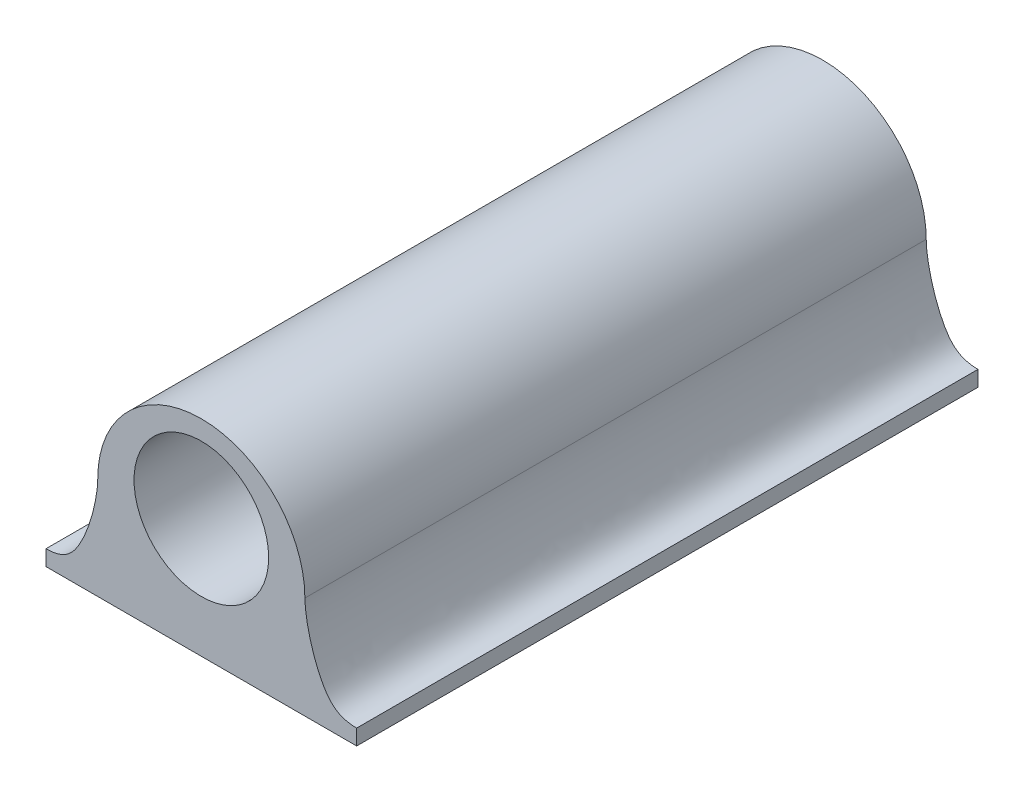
from build123d import *

# Parameters (mm, degrees)
ESTRUSIONE_ESTRUSIONE1_DEPTH      = 30
ESTRUSIONE_ESTRUSIONE1_DEPTH_BACK = 30
SCHIZZO1_W                        = 30
SCHIZZO1_H                        = 1.5
ESTRUSIONE_ESTRUSIONE2_DEPTH      = 30
ESTRUSIONE_ESTRUSIONE2_DEPTH_BACK = 30
SCHIZZO2_R                        = 6.5


with BuildPart() as part:
    # Schizzo1 → Estrusione-Estrusione1 (new, two sides: drawn at the far end of the back side and taken through both)
    with BuildSketch(Plane.XY.offset(-ESTRUSIONE_ESTRUSIONE1_DEPTH_BACK)):
        Rectangle(SCHIZZO1_W, SCHIZZO1_H)
    extrude(amount=ESTRUSIONE_ESTRUSIONE1_DEPTH + ESTRUSIONE_ESTRUSIONE1_DEPTH_BACK)

    # Schizzo2 → Estrusione-Estrusione2 (add, two sides: drawn at the far end of the back side and taken through both)
    with BuildSketch(Plane.XY.offset(-ESTRUSIONE_ESTRUSIONE2_DEPTH_BACK)):
        with BuildLine():
            Line((15, 0.75), (-15, 0.75))
            add(Edge.make_bspline(
                [(-10, 9.120956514), (-10, 7.624111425), (-11.011339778, 3.04349834), (-13.234776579, 0.75), (-15, 0.75)],
                knots=[0, 0, 0, 0, 0.639512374, 1, 1, 1, 1], degree=3))
            ThreePointArc((-10, 9.120956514), (0, 19.120956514), (10, 9.120956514))
            add(Edge.make_bspline(
                [(10, 9.120956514), (10, 7.624111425), (11.011339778, 3.04349834), (13.234776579, 0.75), (15, 0.75)],
                knots=[0, 0, 0, 0, 0.639512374, 1, 1, 1, 1], degree=3))
        make_face()
        with Locations((0, 10.75)):
            Circle(SCHIZZO2_R, mode=Mode.SUBTRACT)
    extrude(amount=ESTRUSIONE_ESTRUSIONE2_DEPTH + ESTRUSIONE_ESTRUSIONE2_DEPTH_BACK)


solid = part.part
